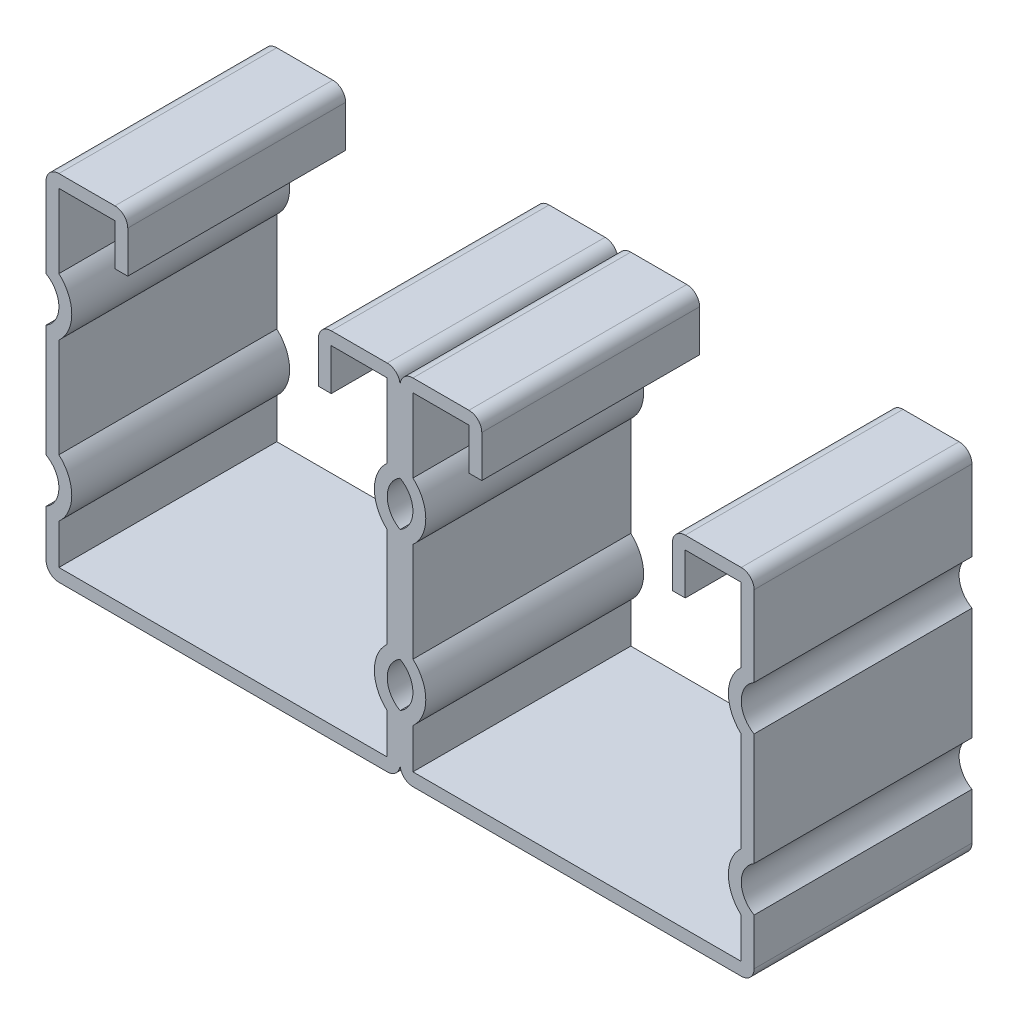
from build123d import *

# Parameters (mm, degrees)
BASE_EXTRUDE_DEPTH = 12.7
LPATTERN1_COUNT    = 2
LPATTERN1_PITCH    = 41.275


with BuildPart() as part:
    # Sketch1 → Base-Extrude (new, symmetric)
    with BuildSketch(Plane.XY):
        with BuildLine():
            Line((-20.6375, 21.1074), (-20.6375, 11.73965134))
            ThreePointArc((-20.6375, 11.73965134), (-19.1389, 9.144), (-20.6375, 6.54834866))
            Line((-20.6375, 6.54834866), (-20.6375, -6.54834866))
            ThreePointArc((-20.6375, -6.54834866), (-19.1389, -9.144), (-20.6375, -11.73965134))
            Line((-20.6375, -11.73965134), (-20.6375, -17.1704))
            ThreePointArc((-20.6375, -17.1704), (-20.198570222, -18.230070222), (-19.1389, -18.669))
            Line((-19.1389, -18.669), (19.1389, -18.669))
            ThreePointArc((19.1389, -18.669), (20.198570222, -18.230070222), (20.6375, -17.1704))
            Line((20.6375, -17.1704), (20.6375, -11.73965134))
            ThreePointArc((20.6375, -11.73965134), (19.1389, -9.144), (20.6375, -6.54834866))
            Line((20.6375, -6.54834866), (20.6375, 6.54834866))
            ThreePointArc((20.6375, 6.54834866), (19.1389, 9.144), (20.6375, 11.73965134))
            Line((20.6375, 11.73965134), (20.6375, 21.1074))
            ThreePointArc((20.6375, 21.1074), (20.198570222, 22.167070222), (19.1389, 22.606))
            Line((19.1389, 22.606), (12.6111, 22.606))
            ThreePointArc((12.6111, 22.606), (11.551429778, 22.167070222), (11.1125, 21.1074))
            Line((11.1125, 21.1074), (11.1125, 16.256))
            Line((11.1125, 16.256), (12.6111, 16.256))
            Line((12.6111, 16.256), (12.6111, 21.1074))
            Line((12.6111, 21.1074), (19.1389, 21.1074))
            Line((19.1389, 21.1074), (19.1389, 12.494971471))
            ThreePointArc((19.1389, 12.494971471), (17.6403, 9.144), (19.1389, 5.793028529))
            Line((19.1389, 5.793028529), (19.1389, -5.793028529))
            ThreePointArc((19.1389, -5.793028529), (17.6403, -9.144), (19.1389, -12.494971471))
            Line((19.1389, -12.494971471), (19.1389, -17.1704))
            Line((19.1389, -17.1704), (-19.1389, -17.1704))
            Line((-19.1389, -17.1704), (-19.1389, -12.494971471))
            ThreePointArc((-19.1389, -12.494971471), (-17.6403, -9.144), (-19.1389, -5.793028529))
            Line((-19.1389, -5.793028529), (-19.1389, 5.793028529))
            ThreePointArc((-19.1389, 5.793028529), (-17.6403, 9.144), (-19.1389, 12.494971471))
            Line((-19.1389, 12.494971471), (-19.1389, 21.1074))
            Line((-19.1389, 21.1074), (-12.6111, 21.1074))
            Line((-12.6111, 21.1074), (-12.6111, 16.256))
            Line((-12.6111, 16.256), (-11.1125, 16.256))
            Line((-11.1125, 16.256), (-11.1125, 21.1074))
            ThreePointArc((-11.1125, 21.1074), (-11.551429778, 22.167070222), (-12.6111, 22.606))
            Line((-12.6111, 22.606), (-19.1389, 22.606))
            ThreePointArc((-19.1389, 22.606), (-20.198570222, 22.167070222), (-20.6375, 21.1074))
        make_face()
    base_extrude = extrude(amount=BASE_EXTRUDE_DEPTH, both=True)

    # LPattern1: Base-Extrude ×2
    with Locations(*[(i * LPATTERN1_PITCH, 0, 0) for i in range(1, LPATTERN1_COUNT)]):
        add(base_extrude)


solid = part.part
